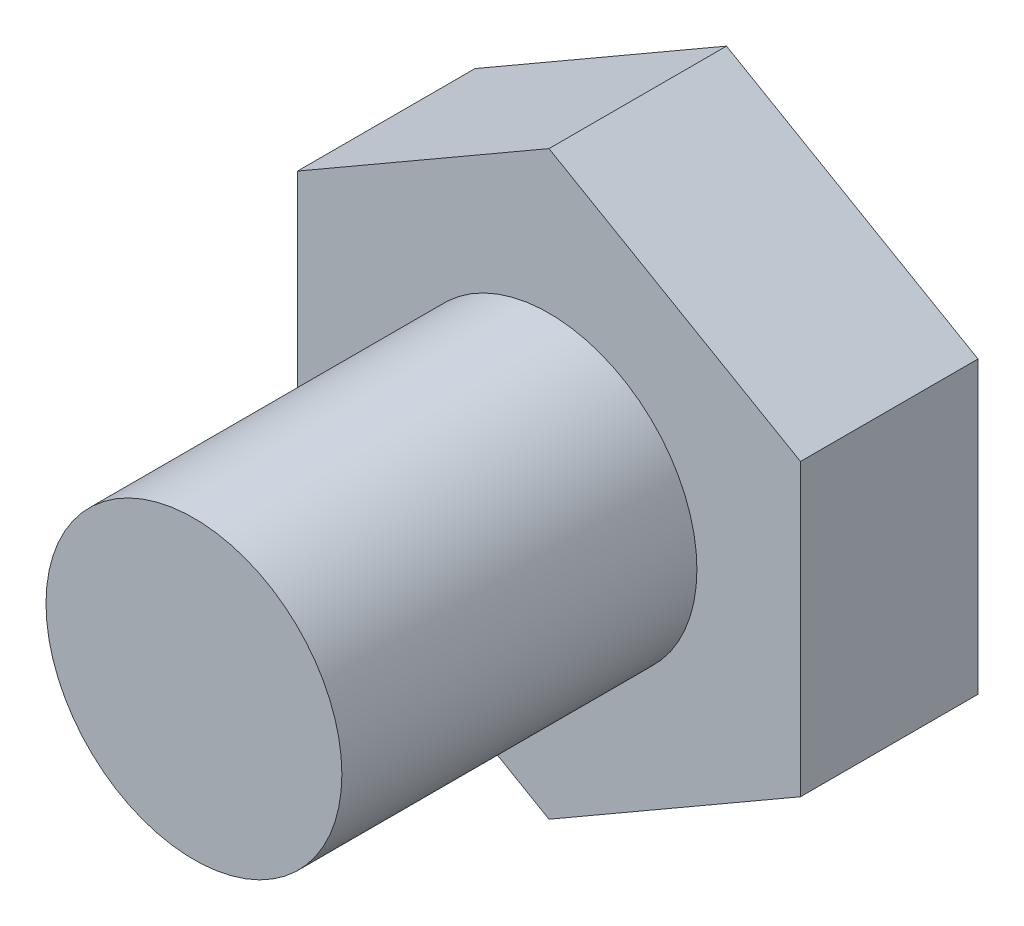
ISO-10303-21;
HEADER;
FILE_DESCRIPTION(('STEP AP214'),'2;1');
FILE_NAME('part.step','',(''),(''),'','','');
FILE_SCHEMA(('AUTOMOTIVE_DESIGN { 1 0 10303 214 1 1 1 1 }'));
ENDSEC;
DATA;
#1=APPLICATION_CONTEXT('core data for automotive mechanical design processes');
#2=APPLICATION_PROTOCOL_DEFINITION('international standard','automotive_design',2000,#1);
#3=PRODUCT_CONTEXT('',#1,'mechanical');
#4=PRODUCT('Part','Part','',(#3));
#5=PRODUCT_RELATED_PRODUCT_CATEGORY('part','',(#4));
#6=PRODUCT_DEFINITION_FORMATION('','',#4);
#7=PRODUCT_DEFINITION_CONTEXT('part definition',#1,'design');
#8=PRODUCT_DEFINITION('design','',#6,#7);
#9=PRODUCT_DEFINITION_SHAPE('','',#8);
#10=(LENGTH_UNIT() NAMED_UNIT(*) SI_UNIT(.MILLI.,.METRE.));
#11=(NAMED_UNIT(*) PLANE_ANGLE_UNIT() SI_UNIT($,.RADIAN.));
#12=(NAMED_UNIT(*) SI_UNIT($,.STERADIAN.) SOLID_ANGLE_UNIT());
#13=UNCERTAINTY_MEASURE_WITH_UNIT(LENGTH_MEASURE(1.E-05),#10,'distance_accuracy_value','');
#14=(GEOMETRIC_REPRESENTATION_CONTEXT(3) GLOBAL_UNCERTAINTY_ASSIGNED_CONTEXT((#13)) GLOBAL_UNIT_ASSIGNED_CONTEXT((#10,
#11,#12)) REPRESENTATION_CONTEXT('',''));
#15=CARTESIAN_POINT('',(0.,0.,0.));
#16=DIRECTION('',(0.,0.,1.));
#17=DIRECTION('',(1.,0.,0.));
#18=AXIS2_PLACEMENT_3D('',#15,#16,#17);
#19=CARTESIAN_POINT('',(0.,0.,19.5));
#20=DIRECTION('',(0.,0.,-1.));
#21=DIRECTION('',(-1.,0.,0.));
#22=AXIS2_PLACEMENT_3D('',#19,#20,#21);
#23=PLANE('',#22);
#24=CARTESIAN_POINT('',(0.,0.,19.5));
#25=DIRECTION('',(0.,0.,-1.));
#26=DIRECTION('',(-1.,0.,0.));
#27=AXIS2_PLACEMENT_3D('',#24,#25,#26);
#28=CIRCLE('',#27,5.);
#29=CARTESIAN_POINT('',(-5.,0.,19.5));
#30=VERTEX_POINT('',#29);
#31=EDGE_CURVE('E21',#30,#30,#28,.T.);
#32=ORIENTED_EDGE('',*,*,#31,.F.);
#33=EDGE_LOOP('',(#32));
#34=FACE_BOUND('',#33,.T.);
#35=ADVANCED_FACE('F14',(#34),#23,.F.);
#36=CARTESIAN_POINT('',(0.,0.,-50.5));
#37=DIRECTION('',(0.,0.,-1.));
#38=DIRECTION('',(-1.,0.,0.));
#39=AXIS2_PLACEMENT_3D('',#36,#37,#38);
#40=CYLINDRICAL_SURFACE('',#39,5.);
#41=CARTESIAN_POINT('',(0.,0.,7.5));
#42=DIRECTION('',(0.,0.,-1.));
#43=DIRECTION('',(-1.,0.,0.));
#44=AXIS2_PLACEMENT_3D('',#41,#42,#43);
#45=CIRCLE('',#44,5.);
#46=CARTESIAN_POINT('',(-5.,0.,7.5));
#47=VERTEX_POINT('',#46);
#48=EDGE_CURVE('E109',#47,#47,#45,.T.);
#49=ORIENTED_EDGE('',*,*,#48,.F.);
#50=EDGE_LOOP('',(#49));
#51=FACE_BOUND('',#50,.T.);
#52=ORIENTED_EDGE('',*,*,#31,.T.);
#53=EDGE_LOOP('',(#52));
#54=FACE_BOUND('',#53,.T.);
#55=ADVANCED_FACE('F114',(#51,#54),#40,.T.);
#56=CARTESIAN_POINT('',(-5.,0.,7.5));
#57=DIRECTION('',(0.,0.,-1.));
#58=DIRECTION('',(-1.,0.,0.));
#59=AXIS2_PLACEMENT_3D('',#56,#57,#58);
#60=PLANE('',#59);
#61=DIRECTION('',(0.866025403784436,-0.5,0.));
#62=VECTOR('',#61,1.);
#63=CARTESIAN_POINT('',(0.500000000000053,9.52627944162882,7.5));
#64=LINE('',#63,#62);
#65=CARTESIAN_POINT('',(0.,9.81495457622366,7.5));
#66=VERTEX_POINT('',#65);
#67=CARTESIAN_POINT('',(8.5,4.90747728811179,7.5));
#68=VERTEX_POINT('',#67);
#69=EDGE_CURVE('E80',#66,#68,#64,.T.);
#70=ORIENTED_EDGE('',*,*,#69,.F.);
#71=DIRECTION('',(-0.866025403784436,-0.5,0.));
#72=VECTOR('',#71,1.);
#73=CARTESIAN_POINT('',(-8.,5.1961524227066,7.5));
#74=LINE('',#73,#72);
#75=CARTESIAN_POINT('',(-8.5,4.90747728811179,7.5));
#76=VERTEX_POINT('',#75);
#77=EDGE_CURVE('E106',#66,#76,#74,.T.);
#78=ORIENTED_EDGE('',*,*,#77,.T.);
#79=DIRECTION('',(0.,-1.,0.));
#80=VECTOR('',#79,1.);
#81=CARTESIAN_POINT('',(-8.5,0.,7.5));
#82=LINE('',#81,#80);
#83=CARTESIAN_POINT('',(-8.5,-4.9074772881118,7.5));
#84=VERTEX_POINT('',#83);
#85=EDGE_CURVE('E103',#76,#84,#82,.T.);
#86=ORIENTED_EDGE('',*,*,#85,.T.);
#87=DIRECTION('',(-0.866025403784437,0.5,0.));
#88=VECTOR('',#87,1.);
#89=CARTESIAN_POINT('',(-8.,-5.19615242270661,7.5));
#90=LINE('',#89,#88);
#91=CARTESIAN_POINT('',(0.,-9.81495457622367,7.5));
#92=VERTEX_POINT('',#91);
#93=EDGE_CURVE('E101',#92,#84,#90,.T.);
#94=ORIENTED_EDGE('',*,*,#93,.F.);
#95=DIRECTION('',(0.866025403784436,0.5,0.));
#96=VECTOR('',#95,1.);
#97=CARTESIAN_POINT('',(0.500000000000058,-9.52627944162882,7.5));
#98=LINE('',#97,#96);
#99=CARTESIAN_POINT('',(8.5,-4.9074772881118,7.5));
#100=VERTEX_POINT('',#99);
#101=EDGE_CURVE('E98',#92,#100,#98,.T.);
#102=ORIENTED_EDGE('',*,*,#101,.T.);
#103=DIRECTION('',(0.,-1.,0.));
#104=VECTOR('',#103,1.);
#105=CARTESIAN_POINT('',(8.5,0.,7.5));
#106=LINE('',#105,#104);
#107=EDGE_CURVE('E96',#68,#100,#106,.T.);
#108=ORIENTED_EDGE('',*,*,#107,.F.);
#109=EDGE_LOOP('',(#70,#78,#86,#94,#102,#108));
#110=FACE_BOUND('',#109,.T.);
#111=ORIENTED_EDGE('',*,*,#48,.T.);
#112=EDGE_LOOP('',(#111));
#113=FACE_BOUND('',#112,.T.);
#114=ADVANCED_FACE('F121',(#110,#113),#60,.F.);
#115=CARTESIAN_POINT('',(0.,9.81495457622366,9.2));
#116=DIRECTION('',(0.5,-0.866025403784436,0.));
#117=DIRECTION('',(-0.866025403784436,-0.5,0.));
#118=AXIS2_PLACEMENT_3D('',#115,#116,#117);
#119=PLANE('',#118);
#120=DIRECTION('',(0.,0.,-1.));
#121=VECTOR('',#120,1.);
#122=CARTESIAN_POINT('',(0.,9.81495457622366,9.2));
#123=LINE('',#122,#121);
#124=CARTESIAN_POINT('',(0.,9.81495457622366,1.5));
#125=VERTEX_POINT('',#124);
#126=EDGE_CURVE('E34',#66,#125,#123,.T.);
#127=ORIENTED_EDGE('',*,*,#126,.T.);
#128=DIRECTION('',(-0.866025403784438,-0.5,0.));
#129=VECTOR('',#128,1.);
#130=CARTESIAN_POINT('',(0.,9.81495457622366,1.5));
#131=LINE('',#130,#129);
#132=CARTESIAN_POINT('',(-8.5,4.90747728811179,1.5));
#133=VERTEX_POINT('',#132);
#134=EDGE_CURVE('E27',#125,#133,#131,.T.);
#135=ORIENTED_EDGE('',*,*,#134,.T.);
#136=DIRECTION('',(0.,0.,-1.));
#137=VECTOR('',#136,1.);
#138=CARTESIAN_POINT('',(-8.5,4.90747728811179,9.2));
#139=LINE('',#138,#137);
#140=EDGE_CURVE('E92',#76,#133,#139,.T.);
#141=ORIENTED_EDGE('',*,*,#140,.F.);
#142=ORIENTED_EDGE('',*,*,#77,.F.);
#143=EDGE_LOOP('',(#127,#135,#141,#142));
#144=FACE_BOUND('',#143,.T.);
#145=ADVANCED_FACE('F126',(#144),#119,.F.);
#146=CARTESIAN_POINT('',(-8.5,4.90747728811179,9.2));
#147=DIRECTION('',(1.,0.,0.));
#148=DIRECTION('',(0.,-1.,0.));
#149=AXIS2_PLACEMENT_3D('',#146,#147,#148);
#150=PLANE('',#149);
#151=ORIENTED_EDGE('',*,*,#140,.T.);
#152=DIRECTION('',(0.,-1.,0.));
#153=VECTOR('',#152,1.);
#154=CARTESIAN_POINT('',(-8.5,4.90747728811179,1.5));
#155=LINE('',#154,#153);
#156=CARTESIAN_POINT('',(-8.5,-4.90747728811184,1.5));
#157=VERTEX_POINT('',#156);
#158=EDGE_CURVE('E173',#133,#157,#155,.T.);
#159=ORIENTED_EDGE('',*,*,#158,.T.);
#160=DIRECTION('',(0.,0.,-1.));
#161=VECTOR('',#160,1.);
#162=CARTESIAN_POINT('',(-8.5,-4.9074772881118,9.2));
#163=LINE('',#162,#161);
#164=EDGE_CURVE('E89',#84,#157,#163,.T.);
#165=ORIENTED_EDGE('',*,*,#164,.F.);
#166=ORIENTED_EDGE('',*,*,#85,.F.);
#167=EDGE_LOOP('',(#151,#159,#165,#166));
#168=FACE_BOUND('',#167,.T.);
#169=ADVANCED_FACE('F131',(#168),#150,.F.);
#170=CARTESIAN_POINT('',(0.,-9.81495457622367,9.2));
#171=DIRECTION('',(-0.5,-0.866025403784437,0.));
#172=DIRECTION('',(-0.866025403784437,0.5,0.));
#173=AXIS2_PLACEMENT_3D('',#170,#171,#172);
#174=PLANE('',#173);
#175=DIRECTION('',(-0.866025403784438,0.5,0.));
#176=VECTOR('',#175,1.);
#177=CARTESIAN_POINT('',(0.,-9.81495457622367,1.5));
#178=LINE('',#177,#176);
#179=CARTESIAN_POINT('',(0.,-9.81495457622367,1.5));
#180=VERTEX_POINT('',#179);
#181=EDGE_CURVE('E171',#180,#157,#178,.T.);
#182=ORIENTED_EDGE('',*,*,#181,.F.);
#183=DIRECTION('',(0.,0.,-1.));
#184=VECTOR('',#183,1.);
#185=CARTESIAN_POINT('',(0.,-9.81495457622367,9.2));
#186=LINE('',#185,#184);
#187=EDGE_CURVE('E82',#92,#180,#186,.T.);
#188=ORIENTED_EDGE('',*,*,#187,.F.);
#189=ORIENTED_EDGE('',*,*,#93,.T.);
#190=ORIENTED_EDGE('',*,*,#164,.T.);
#191=EDGE_LOOP('',(#182,#188,#189,#190));
#192=FACE_BOUND('',#191,.T.);
#193=ADVANCED_FACE('F134',(#192),#174,.T.);
#194=CARTESIAN_POINT('',(0.,-9.81495457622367,9.2));
#195=DIRECTION('',(-0.5,0.866025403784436,0.));
#196=DIRECTION('',(0.866025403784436,0.5,0.));
#197=AXIS2_PLACEMENT_3D('',#194,#195,#196);
#198=PLANE('',#197);
#199=ORIENTED_EDGE('',*,*,#187,.T.);
#200=DIRECTION('',(0.866025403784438,0.5,0.));
#201=VECTOR('',#200,1.);
#202=CARTESIAN_POINT('',(0.,-9.81495457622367,1.5));
#203=LINE('',#202,#201);
#204=CARTESIAN_POINT('',(8.5,-4.9074772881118,1.5));
#205=VERTEX_POINT('',#204);
#206=EDGE_CURVE('E75',#180,#205,#203,.T.);
#207=ORIENTED_EDGE('',*,*,#206,.T.);
#208=DIRECTION('',(0.,0.,-1.));
#209=VECTOR('',#208,1.);
#210=CARTESIAN_POINT('',(8.5,-4.9074772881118,9.2));
#211=LINE('',#210,#209);
#212=EDGE_CURVE('E74',#100,#205,#211,.T.);
#213=ORIENTED_EDGE('',*,*,#212,.F.);
#214=ORIENTED_EDGE('',*,*,#101,.F.);
#215=EDGE_LOOP('',(#199,#207,#213,#214));
#216=FACE_BOUND('',#215,.T.);
#217=ADVANCED_FACE('F138',(#216),#198,.F.);
#218=CARTESIAN_POINT('',(8.5,4.90747728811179,9.2));
#219=DIRECTION('',(1.,0.,0.));
#220=DIRECTION('',(0.,-1.,0.));
#221=AXIS2_PLACEMENT_3D('',#218,#219,#220);
#222=PLANE('',#221);
#223=DIRECTION('',(0.,-1.,0.));
#224=VECTOR('',#223,1.);
#225=CARTESIAN_POINT('',(8.5,4.90747728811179,1.5));
#226=LINE('',#225,#224);
#227=CARTESIAN_POINT('',(8.5,4.90747728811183,1.5));
#228=VERTEX_POINT('',#227);
#229=EDGE_CURVE('E64',#228,#205,#226,.T.);
#230=ORIENTED_EDGE('',*,*,#229,.F.);
#231=DIRECTION('',(0.,0.,-1.));
#232=VECTOR('',#231,1.);
#233=CARTESIAN_POINT('',(8.5,4.90747728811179,9.2));
#234=LINE('',#233,#232);
#235=EDGE_CURVE('E71',#68,#228,#234,.T.);
#236=ORIENTED_EDGE('',*,*,#235,.F.);
#237=ORIENTED_EDGE('',*,*,#107,.T.);
#238=ORIENTED_EDGE('',*,*,#212,.T.);
#239=EDGE_LOOP('',(#230,#236,#237,#238));
#240=FACE_BOUND('',#239,.T.);
#241=ADVANCED_FACE('F70',(#240),#222,.T.);
#242=CARTESIAN_POINT('',(0.,9.81495457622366,9.2));
#243=DIRECTION('',(0.5,0.866025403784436,0.));
#244=DIRECTION('',(0.866025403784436,-0.5,0.));
#245=AXIS2_PLACEMENT_3D('',#242,#243,#244);
#246=PLANE('',#245);
#247=DIRECTION('',(0.866025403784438,-0.5,0.));
#248=VECTOR('',#247,1.);
#249=CARTESIAN_POINT('',(0.,9.81495457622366,1.5));
#250=LINE('',#249,#248);
#251=EDGE_CURVE('E9',#125,#228,#250,.T.);
#252=ORIENTED_EDGE('',*,*,#251,.F.);
#253=ORIENTED_EDGE('',*,*,#126,.F.);
#254=ORIENTED_EDGE('',*,*,#69,.T.);
#255=ORIENTED_EDGE('',*,*,#235,.T.);
#256=EDGE_LOOP('',(#252,#253,#254,#255));
#257=FACE_BOUND('',#256,.T.);
#258=ADVANCED_FACE('F78',(#257),#246,.T.);
#259=CARTESIAN_POINT('',(0.,6.35,1.5));
#260=DIRECTION('',(0.,0.,1.));
#261=DIRECTION('',(1.,0.,0.));
#262=AXIS2_PLACEMENT_3D('',#259,#260,#261);
#263=PLANE('',#262);
#264=CARTESIAN_POINT('',(0.,0.,1.5));
#265=DIRECTION('',(0.,0.,1.));
#266=DIRECTION('',(1.,0.,0.));
#267=AXIS2_PLACEMENT_3D('',#264,#265,#266);
#268=CIRCLE('',#267,6.35);
#269=CARTESIAN_POINT('',(6.35,0.,1.5));
#270=VERTEX_POINT('',#269);
#271=EDGE_CURVE('E164',#270,#270,#268,.T.);
#272=ORIENTED_EDGE('',*,*,#271,.T.);
#273=EDGE_LOOP('',(#272));
#274=FACE_BOUND('',#273,.T.);
#275=ORIENTED_EDGE('',*,*,#251,.T.);
#276=ORIENTED_EDGE('',*,*,#229,.T.);
#277=ORIENTED_EDGE('',*,*,#206,.F.);
#278=ORIENTED_EDGE('',*,*,#181,.T.);
#279=ORIENTED_EDGE('',*,*,#158,.F.);
#280=ORIENTED_EDGE('',*,*,#134,.F.);
#281=EDGE_LOOP('',(#275,#276,#277,#278,#279,#280));
#282=FACE_BOUND('',#281,.T.);
#283=ADVANCED_FACE('F63',(#274,#282),#263,.F.);
#284=CARTESIAN_POINT('',(0.,0.,-20.5));
#285=DIRECTION('',(0.,0.,-1.));
#286=DIRECTION('',(-1.,0.,0.));
#287=AXIS2_PLACEMENT_3D('',#284,#285,#286);
#288=CYLINDRICAL_SURFACE('',#287,6.35);
#289=CARTESIAN_POINT('',(0.,0.,0.));
#290=DIRECTION('',(0.,0.,1.));
#291=DIRECTION('',(1.,0.,0.));
#292=AXIS2_PLACEMENT_3D('',#289,#290,#291);
#293=CIRCLE('',#292,6.35);
#294=CARTESIAN_POINT('',(6.35,0.,0.));
#295=VERTEX_POINT('',#294);
#296=EDGE_CURVE('E76',#295,#295,#293,.T.);
#297=ORIENTED_EDGE('',*,*,#296,.T.);
#298=EDGE_LOOP('',(#297));
#299=FACE_BOUND('',#298,.T.);
#300=ORIENTED_EDGE('',*,*,#271,.F.);
#301=EDGE_LOOP('',(#300));
#302=FACE_BOUND('',#301,.T.);
#303=ADVANCED_FACE('F150',(#299,#302),#288,.T.);
#304=CARTESIAN_POINT('',(0.,0.,0.));
#305=DIRECTION('',(0.,0.,1.));
#306=DIRECTION('',(1.,0.,0.));
#307=AXIS2_PLACEMENT_3D('',#304,#305,#306);
#308=PLANE('',#307);
#309=ORIENTED_EDGE('',*,*,#296,.F.);
#310=EDGE_LOOP('',(#309));
#311=FACE_BOUND('',#310,.T.);
#312=ADVANCED_FACE('F153',(#311),#308,.F.);
#313=CLOSED_SHELL('',(#35,#55,#114,#145,#169,#193,#217,#241,#258,#283,#303,#312));
#314=MANIFOLD_SOLID_BREP('B1',#313);
#315=ADVANCED_BREP_SHAPE_REPRESENTATION('',(#18,#314),#14);
#316=SHAPE_DEFINITION_REPRESENTATION(#9,#315);
ENDSEC;
END-ISO-10303-21;
